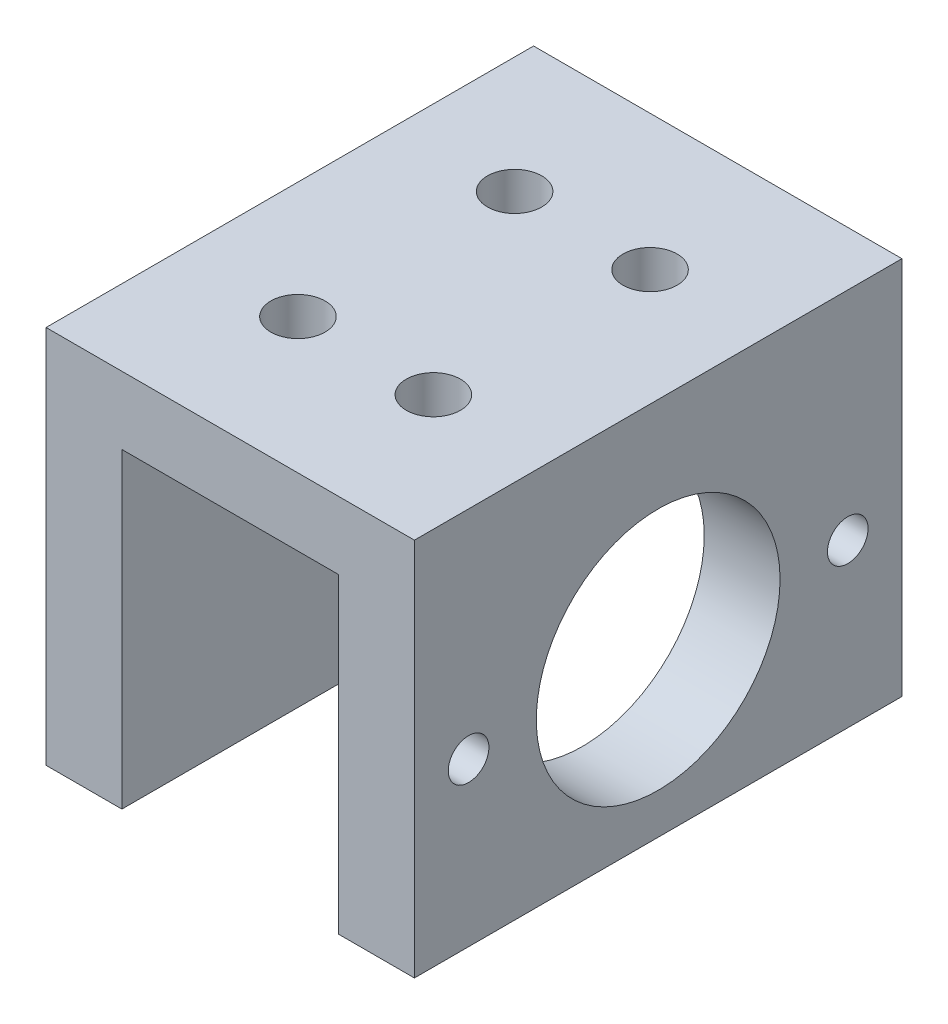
ISO-10303-21;
HEADER;
FILE_DESCRIPTION(('STEP AP214'),'2;1');
FILE_NAME('part.step','',(''),(''),'','','');
FILE_SCHEMA(('AUTOMOTIVE_DESIGN { 1 0 10303 214 1 1 1 1 }'));
ENDSEC;
DATA;
#1=APPLICATION_CONTEXT('core data for automotive mechanical design processes');
#2=APPLICATION_PROTOCOL_DEFINITION('international standard','automotive_design',2000,#1);
#3=PRODUCT_CONTEXT('',#1,'mechanical');
#4=PRODUCT('Part','Part','',(#3));
#5=PRODUCT_RELATED_PRODUCT_CATEGORY('part','',(#4));
#6=PRODUCT_DEFINITION_FORMATION('','',#4);
#7=PRODUCT_DEFINITION_CONTEXT('part definition',#1,'design');
#8=PRODUCT_DEFINITION('design','',#6,#7);
#9=PRODUCT_DEFINITION_SHAPE('','',#8);
#10=(LENGTH_UNIT() NAMED_UNIT(*) SI_UNIT(.MILLI.,.METRE.));
#11=(NAMED_UNIT(*) PLANE_ANGLE_UNIT() SI_UNIT($,.RADIAN.));
#12=(NAMED_UNIT(*) SI_UNIT($,.STERADIAN.) SOLID_ANGLE_UNIT());
#13=UNCERTAINTY_MEASURE_WITH_UNIT(LENGTH_MEASURE(1.E-05),#10,'distance_accuracy_value','');
#14=(GEOMETRIC_REPRESENTATION_CONTEXT(3) GLOBAL_UNCERTAINTY_ASSIGNED_CONTEXT((#13)) GLOBAL_UNIT_ASSIGNED_CONTEXT((#10,
#11,#12)) REPRESENTATION_CONTEXT('',''));
#15=CARTESIAN_POINT('',(0.,0.,0.));
#16=DIRECTION('',(0.,0.,1.));
#17=DIRECTION('',(1.,0.,0.));
#18=AXIS2_PLACEMENT_3D('',#15,#16,#17);
#19=CARTESIAN_POINT('',(-13.6,-28.,18.));
#20=DIRECTION('',(0.,-1.,0.));
#21=DIRECTION('',(0.,0.,-1.));
#22=AXIS2_PLACEMENT_3D('',#19,#20,#21);
#23=PLANE('',#22);
#24=DIRECTION('',(0.,0.,-1.));
#25=VECTOR('',#24,1.);
#26=CARTESIAN_POINT('',(8.,-28.,18.));
#27=LINE('',#26,#25);
#28=CARTESIAN_POINT('',(8.,-28.,18.));
#29=VERTEX_POINT('',#28);
#30=CARTESIAN_POINT('',(8.,-28.,-18.));
#31=VERTEX_POINT('',#30);
#32=EDGE_CURVE('E90',#29,#31,#27,.T.);
#33=ORIENTED_EDGE('',*,*,#32,.T.);
#34=DIRECTION('',(1.,0.,0.));
#35=VECTOR('',#34,1.);
#36=CARTESIAN_POINT('',(-13.6,-28.,-18.));
#37=LINE('',#36,#35);
#38=CARTESIAN_POINT('',(13.6,-28.,-18.));
#39=VERTEX_POINT('',#38);
#40=EDGE_CURVE('E114',#31,#39,#37,.T.);
#41=ORIENTED_EDGE('',*,*,#40,.T.);
#42=DIRECTION('',(0.,0.,-1.));
#43=VECTOR('',#42,1.);
#44=CARTESIAN_POINT('',(13.6,-28.,18.));
#45=LINE('',#44,#43);
#46=CARTESIAN_POINT('',(13.6,-28.,18.));
#47=VERTEX_POINT('',#46);
#48=EDGE_CURVE('E109',#47,#39,#45,.T.);
#49=ORIENTED_EDGE('',*,*,#48,.F.);
#50=DIRECTION('',(1.,0.,0.));
#51=VECTOR('',#50,1.);
#52=CARTESIAN_POINT('',(-13.6,-28.,18.));
#53=LINE('',#52,#51);
#54=EDGE_CURVE('E102',#29,#47,#53,.T.);
#55=ORIENTED_EDGE('',*,*,#54,.F.);
#56=EDGE_LOOP('',(#33,#41,#49,#55));
#57=FACE_BOUND('',#56,.T.);
#58=ADVANCED_FACE('F16',(#57),#23,.T.);
#59=CARTESIAN_POINT('',(-13.6,0.,-18.));
#60=DIRECTION('',(0.,1.,0.));
#61=DIRECTION('',(0.,0.,1.));
#62=AXIS2_PLACEMENT_3D('',#59,#60,#61);
#63=PLANE('',#62);
#64=CARTESIAN_POINT('',(5.,0.,8.));
#65=DIRECTION('',(0.,1.,0.));
#66=DIRECTION('',(0.,0.,1.));
#67=AXIS2_PLACEMENT_3D('',#64,#65,#66);
#68=CIRCLE('',#67,2.);
#69=CARTESIAN_POINT('',(5.,0.,10.));
#70=VERTEX_POINT('',#69);
#71=EDGE_CURVE('E179',#70,#70,#68,.T.);
#72=ORIENTED_EDGE('',*,*,#71,.F.);
#73=EDGE_LOOP('',(#72));
#74=FACE_BOUND('',#73,.T.);
#75=CARTESIAN_POINT('',(-5.,0.,8.));
#76=DIRECTION('',(0.,1.,0.));
#77=DIRECTION('',(0.,0.,1.));
#78=AXIS2_PLACEMENT_3D('',#75,#76,#77);
#79=CIRCLE('',#78,2.);
#80=CARTESIAN_POINT('',(-5.,0.,10.));
#81=VERTEX_POINT('',#80);
#82=EDGE_CURVE('E173',#81,#81,#79,.T.);
#83=ORIENTED_EDGE('',*,*,#82,.F.);
#84=EDGE_LOOP('',(#83));
#85=FACE_BOUND('',#84,.T.);
#86=CARTESIAN_POINT('',(-5.,0.,-8.));
#87=DIRECTION('',(0.,1.,0.));
#88=DIRECTION('',(0.,0.,1.));
#89=AXIS2_PLACEMENT_3D('',#86,#87,#88);
#90=CIRCLE('',#89,2.);
#91=CARTESIAN_POINT('',(-5.,0.,-6.));
#92=VERTEX_POINT('',#91);
#93=EDGE_CURVE('E170',#92,#92,#90,.T.);
#94=ORIENTED_EDGE('',*,*,#93,.F.);
#95=EDGE_LOOP('',(#94));
#96=FACE_BOUND('',#95,.T.);
#97=CARTESIAN_POINT('',(5.,0.,-8.));
#98=DIRECTION('',(0.,1.,0.));
#99=DIRECTION('',(0.,0.,1.));
#100=AXIS2_PLACEMENT_3D('',#97,#98,#99);
#101=CIRCLE('',#100,2.);
#102=CARTESIAN_POINT('',(5.,0.,-6.));
#103=VERTEX_POINT('',#102);
#104=EDGE_CURVE('E164',#103,#103,#101,.T.);
#105=ORIENTED_EDGE('',*,*,#104,.F.);
#106=EDGE_LOOP('',(#105));
#107=FACE_BOUND('',#106,.T.);
#108=DIRECTION('',(0.,0.,1.));
#109=VECTOR('',#108,1.);
#110=CARTESIAN_POINT('',(13.6,0.,-18.));
#111=LINE('',#110,#109);
#112=CARTESIAN_POINT('',(13.6,0.,-18.));
#113=VERTEX_POINT('',#112);
#114=CARTESIAN_POINT('',(13.6,0.,18.));
#115=VERTEX_POINT('',#114);
#116=EDGE_CURVE('E126',#113,#115,#111,.T.);
#117=ORIENTED_EDGE('',*,*,#116,.F.);
#118=DIRECTION('',(1.,0.,0.));
#119=VECTOR('',#118,1.);
#120=CARTESIAN_POINT('',(-13.6,0.,-18.));
#121=LINE('',#120,#119);
#122=CARTESIAN_POINT('',(-13.6,0.,-18.));
#123=VERTEX_POINT('',#122);
#124=EDGE_CURVE('E10',#123,#113,#121,.T.);
#125=ORIENTED_EDGE('',*,*,#124,.F.);
#126=DIRECTION('',(0.,0.,1.));
#127=VECTOR('',#126,1.);
#128=CARTESIAN_POINT('',(-13.6,0.,-18.));
#129=LINE('',#128,#127);
#130=CARTESIAN_POINT('',(-13.6,0.,18.));
#131=VERTEX_POINT('',#130);
#132=EDGE_CURVE('E122',#123,#131,#129,.T.);
#133=ORIENTED_EDGE('',*,*,#132,.T.);
#134=DIRECTION('',(1.,0.,0.));
#135=VECTOR('',#134,1.);
#136=CARTESIAN_POINT('',(-13.6,0.,18.));
#137=LINE('',#136,#135);
#138=EDGE_CURVE('E66',#131,#115,#137,.T.);
#139=ORIENTED_EDGE('',*,*,#138,.T.);
#140=EDGE_LOOP('',(#117,#125,#133,#139));
#141=FACE_BOUND('',#140,.T.);
#142=ADVANCED_FACE('F18',(#74,#85,#96,#107,#141),#63,.T.);
#143=CARTESIAN_POINT('',(-13.6,-28.,-18.));
#144=DIRECTION('',(0.,0.,-1.));
#145=DIRECTION('',(-1.,0.,0.));
#146=AXIS2_PLACEMENT_3D('',#143,#144,#145);
#147=PLANE('',#146);
#148=DIRECTION('',(0.,-1.,0.));
#149=VECTOR('',#148,1.);
#150=CARTESIAN_POINT('',(8.,-5.,-18.));
#151=LINE('',#150,#149);
#152=CARTESIAN_POINT('',(8.,-5.,-18.));
#153=VERTEX_POINT('',#152);
#154=EDGE_CURVE('E95',#153,#31,#151,.T.);
#155=ORIENTED_EDGE('',*,*,#154,.F.);
#156=DIRECTION('',(1.,0.,0.));
#157=VECTOR('',#156,1.);
#158=CARTESIAN_POINT('',(-8.,-5.,-18.));
#159=LINE('',#158,#157);
#160=CARTESIAN_POINT('',(-8.,-5.,-18.));
#161=VERTEX_POINT('',#160);
#162=EDGE_CURVE('E106',#161,#153,#159,.T.);
#163=ORIENTED_EDGE('',*,*,#162,.F.);
#164=DIRECTION('',(0.,1.,0.));
#165=VECTOR('',#164,1.);
#166=CARTESIAN_POINT('',(-8.,-28.,-18.));
#167=LINE('',#166,#165);
#168=CARTESIAN_POINT('',(-8.,-28.,-18.));
#169=VERTEX_POINT('',#168);
#170=EDGE_CURVE('E143',#169,#161,#167,.T.);
#171=ORIENTED_EDGE('',*,*,#170,.F.);
#172=CARTESIAN_POINT('',(-13.6,-28.,-18.));
#173=VERTEX_POINT('',#172);
#174=EDGE_CURVE('E25',#173,#169,#37,.T.);
#175=ORIENTED_EDGE('',*,*,#174,.F.);
#176=DIRECTION('',(0.,1.,0.));
#177=VECTOR('',#176,1.);
#178=CARTESIAN_POINT('',(-13.6,-28.,-18.));
#179=LINE('',#178,#177);
#180=EDGE_CURVE('E115',#173,#123,#179,.T.);
#181=ORIENTED_EDGE('',*,*,#180,.T.);
#182=ORIENTED_EDGE('',*,*,#124,.T.);
#183=DIRECTION('',(0.,1.,0.));
#184=VECTOR('',#183,1.);
#185=CARTESIAN_POINT('',(13.6,-28.,-18.));
#186=LINE('',#185,#184);
#187=EDGE_CURVE('E119',#39,#113,#186,.T.);
#188=ORIENTED_EDGE('',*,*,#187,.F.);
#189=ORIENTED_EDGE('',*,*,#40,.F.);
#190=EDGE_LOOP('',(#155,#163,#171,#175,#181,#182,#188,#189));
#191=FACE_BOUND('',#190,.T.);
#192=ADVANCED_FACE('F203',(#191),#147,.T.);
#193=DIRECTION('',(0.,0.,-1.));
#194=VECTOR('',#193,1.);
#195=CARTESIAN_POINT('',(-8.,-28.,18.));
#196=LINE('',#195,#194);
#197=CARTESIAN_POINT('',(-8.,-28.,18.));
#198=VERTEX_POINT('',#197);
#199=EDGE_CURVE('E99',#198,#169,#196,.T.);
#200=ORIENTED_EDGE('',*,*,#199,.F.);
#201=CARTESIAN_POINT('',(-13.6,-28.,18.));
#202=VERTEX_POINT('',#201);
#203=EDGE_CURVE('E111',#202,#198,#53,.T.);
#204=ORIENTED_EDGE('',*,*,#203,.F.);
#205=DIRECTION('',(0.,0.,-1.));
#206=VECTOR('',#205,1.);
#207=CARTESIAN_POINT('',(-13.6,-28.,18.));
#208=LINE('',#207,#206);
#209=EDGE_CURVE('E131',#202,#173,#208,.T.);
#210=ORIENTED_EDGE('',*,*,#209,.T.);
#211=ORIENTED_EDGE('',*,*,#174,.T.);
#212=EDGE_LOOP('',(#200,#204,#210,#211));
#213=FACE_BOUND('',#212,.T.);
#214=ADVANCED_FACE('F208',(#213),#23,.T.);
#215=CARTESIAN_POINT('',(-13.6,0.,18.));
#216=DIRECTION('',(0.,0.,1.));
#217=DIRECTION('',(1.,0.,0.));
#218=AXIS2_PLACEMENT_3D('',#215,#216,#217);
#219=PLANE('',#218);
#220=DIRECTION('',(0.,-1.,0.));
#221=VECTOR('',#220,1.);
#222=CARTESIAN_POINT('',(8.,-5.,18.));
#223=LINE('',#222,#221);
#224=CARTESIAN_POINT('',(8.,-5.,18.));
#225=VERTEX_POINT('',#224);
#226=EDGE_CURVE('E93',#225,#29,#223,.T.);
#227=ORIENTED_EDGE('',*,*,#226,.T.);
#228=ORIENTED_EDGE('',*,*,#54,.T.);
#229=DIRECTION('',(0.,-1.,0.));
#230=VECTOR('',#229,1.);
#231=CARTESIAN_POINT('',(13.6,0.,18.));
#232=LINE('',#231,#230);
#233=EDGE_CURVE('E124',#115,#47,#232,.T.);
#234=ORIENTED_EDGE('',*,*,#233,.F.);
#235=ORIENTED_EDGE('',*,*,#138,.F.);
#236=DIRECTION('',(0.,-1.,0.));
#237=VECTOR('',#236,1.);
#238=CARTESIAN_POINT('',(-13.6,0.,18.));
#239=LINE('',#238,#237);
#240=EDGE_CURVE('E134',#131,#202,#239,.T.);
#241=ORIENTED_EDGE('',*,*,#240,.T.);
#242=ORIENTED_EDGE('',*,*,#203,.T.);
#243=DIRECTION('',(0.,1.,0.));
#244=VECTOR('',#243,1.);
#245=CARTESIAN_POINT('',(-8.,-28.,18.));
#246=LINE('',#245,#244);
#247=CARTESIAN_POINT('',(-8.,-5.,18.));
#248=VERTEX_POINT('',#247);
#249=EDGE_CURVE('E105',#198,#248,#246,.T.);
#250=ORIENTED_EDGE('',*,*,#249,.T.);
#251=DIRECTION('',(1.,0.,0.));
#252=VECTOR('',#251,1.);
#253=CARTESIAN_POINT('',(-8.,-5.,18.));
#254=LINE('',#253,#252);
#255=EDGE_CURVE('E33',#248,#225,#254,.T.);
#256=ORIENTED_EDGE('',*,*,#255,.T.);
#257=EDGE_LOOP('',(#227,#228,#234,#235,#241,#242,#250,#256));
#258=FACE_BOUND('',#257,.T.);
#259=ADVANCED_FACE('F101',(#258),#219,.T.);
#260=CARTESIAN_POINT('',(-13.6,0.,0.));
#261=DIRECTION('',(1.,0.,0.));
#262=DIRECTION('',(0.,0.,-1.));
#263=AXIS2_PLACEMENT_3D('',#260,#261,#262);
#264=PLANE('',#263);
#265=ORIENTED_EDGE('',*,*,#132,.F.);
#266=ORIENTED_EDGE('',*,*,#180,.F.);
#267=ORIENTED_EDGE('',*,*,#209,.F.);
#268=ORIENTED_EDGE('',*,*,#240,.F.);
#269=EDGE_LOOP('',(#265,#266,#267,#268));
#270=FACE_BOUND('',#269,.T.);
#271=ADVANCED_FACE('F194',(#270),#264,.F.);
#272=CARTESIAN_POINT('',(13.6,0.,0.));
#273=DIRECTION('',(1.,0.,0.));
#274=DIRECTION('',(0.,0.,-1.));
#275=AXIS2_PLACEMENT_3D('',#272,#273,#274);
#276=PLANE('',#275);
#277=CARTESIAN_POINT('',(13.6,-16.,0.));
#278=DIRECTION('',(1.,0.,0.));
#279=DIRECTION('',(0.,0.,-1.));
#280=AXIS2_PLACEMENT_3D('',#277,#278,#279);
#281=CIRCLE('',#280,9.);
#282=CARTESIAN_POINT('',(13.6,-16.,-9.));
#283=VERTEX_POINT('',#282);
#284=EDGE_CURVE('E185',#283,#283,#281,.T.);
#285=ORIENTED_EDGE('',*,*,#284,.F.);
#286=EDGE_LOOP('',(#285));
#287=FACE_BOUND('',#286,.T.);
#288=CARTESIAN_POINT('',(13.6,-16.,14.));
#289=DIRECTION('',(1.,0.,0.));
#290=DIRECTION('',(0.,0.,-1.));
#291=AXIS2_PLACEMENT_3D('',#288,#289,#290);
#292=CIRCLE('',#291,1.49999999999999);
#293=CARTESIAN_POINT('',(13.6,-16.,12.5));
#294=VERTEX_POINT('',#293);
#295=EDGE_CURVE('E158',#294,#294,#292,.T.);
#296=ORIENTED_EDGE('',*,*,#295,.F.);
#297=EDGE_LOOP('',(#296));
#298=FACE_BOUND('',#297,.T.);
#299=CARTESIAN_POINT('',(13.6,-16.,-14.));
#300=DIRECTION('',(1.,0.,0.));
#301=DIRECTION('',(0.,0.,-1.));
#302=AXIS2_PLACEMENT_3D('',#299,#300,#301);
#303=CIRCLE('',#302,1.49999999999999);
#304=CARTESIAN_POINT('',(13.6,-16.,-15.5));
#305=VERTEX_POINT('',#304);
#306=EDGE_CURVE('E152',#305,#305,#303,.T.);
#307=ORIENTED_EDGE('',*,*,#306,.F.);
#308=EDGE_LOOP('',(#307));
#309=FACE_BOUND('',#308,.T.);
#310=ORIENTED_EDGE('',*,*,#116,.T.);
#311=ORIENTED_EDGE('',*,*,#233,.T.);
#312=ORIENTED_EDGE('',*,*,#48,.T.);
#313=ORIENTED_EDGE('',*,*,#187,.T.);
#314=EDGE_LOOP('',(#310,#311,#312,#313));
#315=FACE_BOUND('',#314,.T.);
#316=ADVANCED_FACE('F191',(#287,#298,#309,#315),#276,.T.);
#317=CARTESIAN_POINT('',(8.,-5.,18.));
#318=DIRECTION('',(1.,0.,0.));
#319=DIRECTION('',(0.,0.,-1.));
#320=AXIS2_PLACEMENT_3D('',#317,#318,#319);
#321=PLANE('',#320);
#322=CARTESIAN_POINT('',(8.,-16.,0.));
#323=DIRECTION('',(1.,0.,0.));
#324=DIRECTION('',(0.,0.,-1.));
#325=AXIS2_PLACEMENT_3D('',#322,#323,#324);
#326=CIRCLE('',#325,9.);
#327=CARTESIAN_POINT('',(8.,-16.,-9.));
#328=VERTEX_POINT('',#327);
#329=EDGE_CURVE('E182',#328,#328,#326,.T.);
#330=ORIENTED_EDGE('',*,*,#329,.T.);
#331=EDGE_LOOP('',(#330));
#332=FACE_BOUND('',#331,.T.);
#333=CARTESIAN_POINT('',(8.,-16.,14.));
#334=DIRECTION('',(1.,0.,0.));
#335=DIRECTION('',(0.,0.,-1.));
#336=AXIS2_PLACEMENT_3D('',#333,#334,#335);
#337=CIRCLE('',#336,1.5);
#338=CARTESIAN_POINT('',(8.,-16.,12.5));
#339=VERTEX_POINT('',#338);
#340=EDGE_CURVE('E155',#339,#339,#337,.T.);
#341=ORIENTED_EDGE('',*,*,#340,.T.);
#342=EDGE_LOOP('',(#341));
#343=FACE_BOUND('',#342,.T.);
#344=CARTESIAN_POINT('',(8.,-16.,-14.));
#345=DIRECTION('',(1.,0.,0.));
#346=DIRECTION('',(0.,0.,-1.));
#347=AXIS2_PLACEMENT_3D('',#344,#345,#346);
#348=CIRCLE('',#347,1.5);
#349=CARTESIAN_POINT('',(8.,-16.,-15.5));
#350=VERTEX_POINT('',#349);
#351=EDGE_CURVE('E147',#350,#350,#348,.T.);
#352=ORIENTED_EDGE('',*,*,#351,.T.);
#353=EDGE_LOOP('',(#352));
#354=FACE_BOUND('',#353,.T.);
#355=ORIENTED_EDGE('',*,*,#154,.T.);
#356=ORIENTED_EDGE('',*,*,#32,.F.);
#357=ORIENTED_EDGE('',*,*,#226,.F.);
#358=DIRECTION('',(0.,0.,-1.));
#359=VECTOR('',#358,1.);
#360=CARTESIAN_POINT('',(8.,-5.,18.));
#361=LINE('',#360,#359);
#362=EDGE_CURVE('E129',#225,#153,#361,.T.);
#363=ORIENTED_EDGE('',*,*,#362,.T.);
#364=EDGE_LOOP('',(#355,#356,#357,#363));
#365=FACE_BOUND('',#364,.T.);
#366=ADVANCED_FACE('F92',(#332,#343,#354,#365),#321,.F.);
#367=CARTESIAN_POINT('',(-8.,-5.,18.));
#368=DIRECTION('',(0.,1.,0.));
#369=DIRECTION('',(0.,0.,1.));
#370=AXIS2_PLACEMENT_3D('',#367,#368,#369);
#371=PLANE('',#370);
#372=CARTESIAN_POINT('',(5.,-5.,8.));
#373=DIRECTION('',(0.,1.,0.));
#374=DIRECTION('',(0.,0.,1.));
#375=AXIS2_PLACEMENT_3D('',#372,#373,#374);
#376=CIRCLE('',#375,2.);
#377=CARTESIAN_POINT('',(5.,-5.,10.));
#378=VERTEX_POINT('',#377);
#379=EDGE_CURVE('E176',#378,#378,#376,.T.);
#380=ORIENTED_EDGE('',*,*,#379,.T.);
#381=EDGE_LOOP('',(#380));
#382=FACE_BOUND('',#381,.T.);
#383=CARTESIAN_POINT('',(-5.,-5.,8.));
#384=DIRECTION('',(0.,1.,0.));
#385=DIRECTION('',(0.,0.,1.));
#386=AXIS2_PLACEMENT_3D('',#383,#384,#385);
#387=CIRCLE('',#386,2.);
#388=CARTESIAN_POINT('',(-5.,-5.,10.));
#389=VERTEX_POINT('',#388);
#390=EDGE_CURVE('E20',#389,#389,#387,.T.);
#391=ORIENTED_EDGE('',*,*,#390,.T.);
#392=EDGE_LOOP('',(#391));
#393=FACE_BOUND('',#392,.T.);
#394=CARTESIAN_POINT('',(-5.,-5.,-8.));
#395=DIRECTION('',(0.,1.,0.));
#396=DIRECTION('',(0.,0.,1.));
#397=AXIS2_PLACEMENT_3D('',#394,#395,#396);
#398=CIRCLE('',#397,2.);
#399=CARTESIAN_POINT('',(-5.,-5.,-6.));
#400=VERTEX_POINT('',#399);
#401=EDGE_CURVE('E167',#400,#400,#398,.T.);
#402=ORIENTED_EDGE('',*,*,#401,.T.);
#403=EDGE_LOOP('',(#402));
#404=FACE_BOUND('',#403,.T.);
#405=CARTESIAN_POINT('',(5.,-5.,-8.));
#406=DIRECTION('',(0.,1.,0.));
#407=DIRECTION('',(0.,0.,1.));
#408=AXIS2_PLACEMENT_3D('',#405,#406,#407);
#409=CIRCLE('',#408,2.);
#410=CARTESIAN_POINT('',(5.,-5.,-6.));
#411=VERTEX_POINT('',#410);
#412=EDGE_CURVE('E161',#411,#411,#409,.T.);
#413=ORIENTED_EDGE('',*,*,#412,.T.);
#414=EDGE_LOOP('',(#413));
#415=FACE_BOUND('',#414,.T.);
#416=ORIENTED_EDGE('',*,*,#162,.T.);
#417=ORIENTED_EDGE('',*,*,#362,.F.);
#418=ORIENTED_EDGE('',*,*,#255,.F.);
#419=DIRECTION('',(0.,0.,-1.));
#420=VECTOR('',#419,1.);
#421=CARTESIAN_POINT('',(-8.,-5.,18.));
#422=LINE('',#421,#420);
#423=EDGE_CURVE('E138',#248,#161,#422,.T.);
#424=ORIENTED_EDGE('',*,*,#423,.T.);
#425=EDGE_LOOP('',(#416,#417,#418,#424));
#426=FACE_BOUND('',#425,.T.);
#427=ADVANCED_FACE('F211',(#382,#393,#404,#415,#426),#371,.F.);
#428=CARTESIAN_POINT('',(-8.,-28.,18.));
#429=DIRECTION('',(-1.,0.,0.));
#430=DIRECTION('',(0.,0.,1.));
#431=AXIS2_PLACEMENT_3D('',#428,#429,#430);
#432=PLANE('',#431);
#433=ORIENTED_EDGE('',*,*,#170,.T.);
#434=ORIENTED_EDGE('',*,*,#423,.F.);
#435=ORIENTED_EDGE('',*,*,#249,.F.);
#436=ORIENTED_EDGE('',*,*,#199,.T.);
#437=EDGE_LOOP('',(#433,#434,#435,#436));
#438=FACE_BOUND('',#437,.T.);
#439=ADVANCED_FACE('F210',(#438),#432,.F.);
#440=CARTESIAN_POINT('',(13.6,-16.,-14.));
#441=DIRECTION('',(1.,0.,0.));
#442=DIRECTION('',(0.,0.,-1.));
#443=AXIS2_PLACEMENT_3D('',#440,#441,#442);
#444=CYLINDRICAL_SURFACE('',#443,1.5);
#445=ORIENTED_EDGE('',*,*,#351,.F.);
#446=EDGE_LOOP('',(#445));
#447=FACE_BOUND('',#446,.T.);
#448=ORIENTED_EDGE('',*,*,#306,.T.);
#449=EDGE_LOOP('',(#448));
#450=FACE_BOUND('',#449,.T.);
#451=ADVANCED_FACE('F221',(#447,#450),#444,.F.);
#452=CARTESIAN_POINT('',(13.6,-16.,14.));
#453=DIRECTION('',(1.,0.,0.));
#454=DIRECTION('',(0.,0.,-1.));
#455=AXIS2_PLACEMENT_3D('',#452,#453,#454);
#456=CYLINDRICAL_SURFACE('',#455,1.5);
#457=ORIENTED_EDGE('',*,*,#340,.F.);
#458=EDGE_LOOP('',(#457));
#459=FACE_BOUND('',#458,.T.);
#460=ORIENTED_EDGE('',*,*,#295,.T.);
#461=EDGE_LOOP('',(#460));
#462=FACE_BOUND('',#461,.T.);
#463=ADVANCED_FACE('F285',(#459,#462),#456,.F.);
#464=CARTESIAN_POINT('',(5.,0.,-8.));
#465=DIRECTION('',(0.,1.,0.));
#466=DIRECTION('',(0.,0.,1.));
#467=AXIS2_PLACEMENT_3D('',#464,#465,#466);
#468=CYLINDRICAL_SURFACE('',#467,2.);
#469=ORIENTED_EDGE('',*,*,#104,.T.);
#470=EDGE_LOOP('',(#469));
#471=FACE_BOUND('',#470,.T.);
#472=ORIENTED_EDGE('',*,*,#412,.F.);
#473=EDGE_LOOP('',(#472));
#474=FACE_BOUND('',#473,.T.);
#475=ADVANCED_FACE('F292',(#471,#474),#468,.F.);
#476=CARTESIAN_POINT('',(-5.,0.,-8.));
#477=DIRECTION('',(0.,1.,0.));
#478=DIRECTION('',(0.,0.,1.));
#479=AXIS2_PLACEMENT_3D('',#476,#477,#478);
#480=CYLINDRICAL_SURFACE('',#479,2.);
#481=ORIENTED_EDGE('',*,*,#93,.T.);
#482=EDGE_LOOP('',(#481));
#483=FACE_BOUND('',#482,.T.);
#484=ORIENTED_EDGE('',*,*,#401,.F.);
#485=EDGE_LOOP('',(#484));
#486=FACE_BOUND('',#485,.T.);
#487=ADVANCED_FACE('F300',(#483,#486),#480,.F.);
#488=CARTESIAN_POINT('',(-5.,0.,8.));
#489=DIRECTION('',(0.,1.,0.));
#490=DIRECTION('',(0.,0.,1.));
#491=AXIS2_PLACEMENT_3D('',#488,#489,#490);
#492=CYLINDRICAL_SURFACE('',#491,2.);
#493=ORIENTED_EDGE('',*,*,#82,.T.);
#494=EDGE_LOOP('',(#493));
#495=FACE_BOUND('',#494,.T.);
#496=ORIENTED_EDGE('',*,*,#390,.F.);
#497=EDGE_LOOP('',(#496));
#498=FACE_BOUND('',#497,.T.);
#499=ADVANCED_FACE('F308',(#495,#498),#492,.F.);
#500=CARTESIAN_POINT('',(5.,0.,8.));
#501=DIRECTION('',(0.,1.,0.));
#502=DIRECTION('',(0.,0.,1.));
#503=AXIS2_PLACEMENT_3D('',#500,#501,#502);
#504=CYLINDRICAL_SURFACE('',#503,2.);
#505=ORIENTED_EDGE('',*,*,#71,.T.);
#506=EDGE_LOOP('',(#505));
#507=FACE_BOUND('',#506,.T.);
#508=ORIENTED_EDGE('',*,*,#379,.F.);
#509=EDGE_LOOP('',(#508));
#510=FACE_BOUND('',#509,.T.);
#511=ADVANCED_FACE('F316',(#507,#510),#504,.F.);
#512=CARTESIAN_POINT('',(13.6,-16.,0.));
#513=DIRECTION('',(1.,0.,0.));
#514=DIRECTION('',(0.,0.,-1.));
#515=AXIS2_PLACEMENT_3D('',#512,#513,#514);
#516=CYLINDRICAL_SURFACE('',#515,9.);
#517=ORIENTED_EDGE('',*,*,#329,.F.);
#518=EDGE_LOOP('',(#517));
#519=FACE_BOUND('',#518,.T.);
#520=ORIENTED_EDGE('',*,*,#284,.T.);
#521=EDGE_LOOP('',(#520));
#522=FACE_BOUND('',#521,.T.);
#523=ADVANCED_FACE('F189',(#519,#522),#516,.F.);
#524=CLOSED_SHELL('',(#58,#142,#192,#214,#259,#271,#316,#366,#427,#439,#451,#463,#475,#487,#499,
#511,#523));
#525=MANIFOLD_SOLID_BREP('B1',#524);
#526=ADVANCED_BREP_SHAPE_REPRESENTATION('',(#18,#525),#14);
#527=SHAPE_DEFINITION_REPRESENTATION(#9,#526);
ENDSEC;
END-ISO-10303-21;
